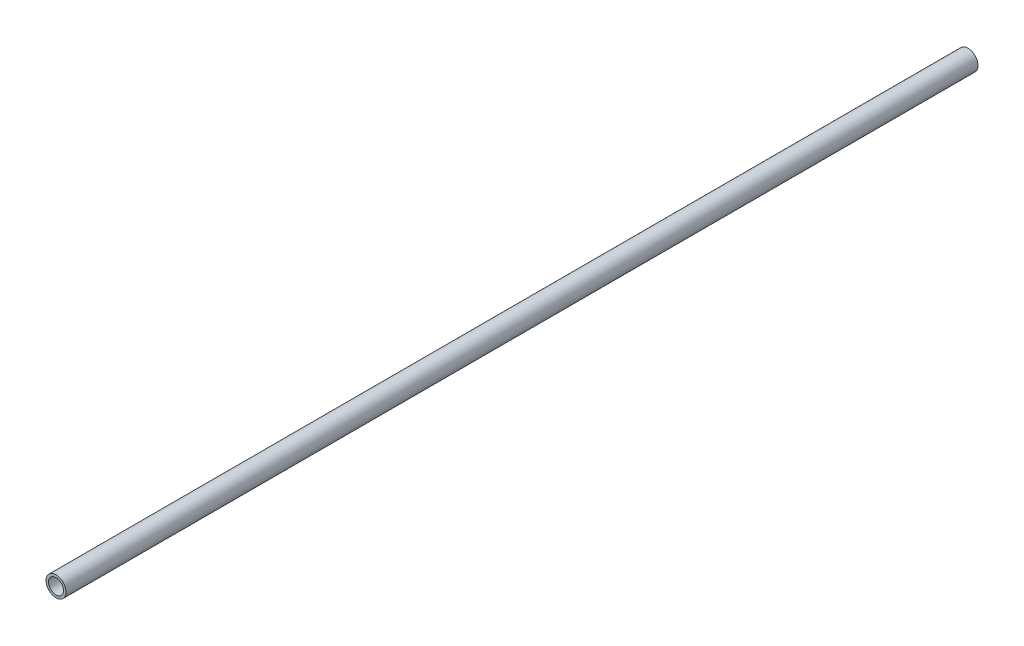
from build123d import *

# Parameters (mm, degrees)
ESQUISSE1_R      = 4
ESQUISSE1_R_2    = 3
EXTRUSION1_DEPTH = 365


with BuildPart() as part:
    # Esquisse1 → Extrusion1 (new body)
    with BuildSketch(Plane.XY):
        with Locations(Location((0, 0, 0), (0, 0, 180))):
            Circle(ESQUISSE1_R)
        with Locations(Location((0, 0, 0), (0, 0, 180))):
            Circle(ESQUISSE1_R_2, mode=Mode.SUBTRACT)
    extrude(amount=EXTRUSION1_DEPTH)


solid = part.part
